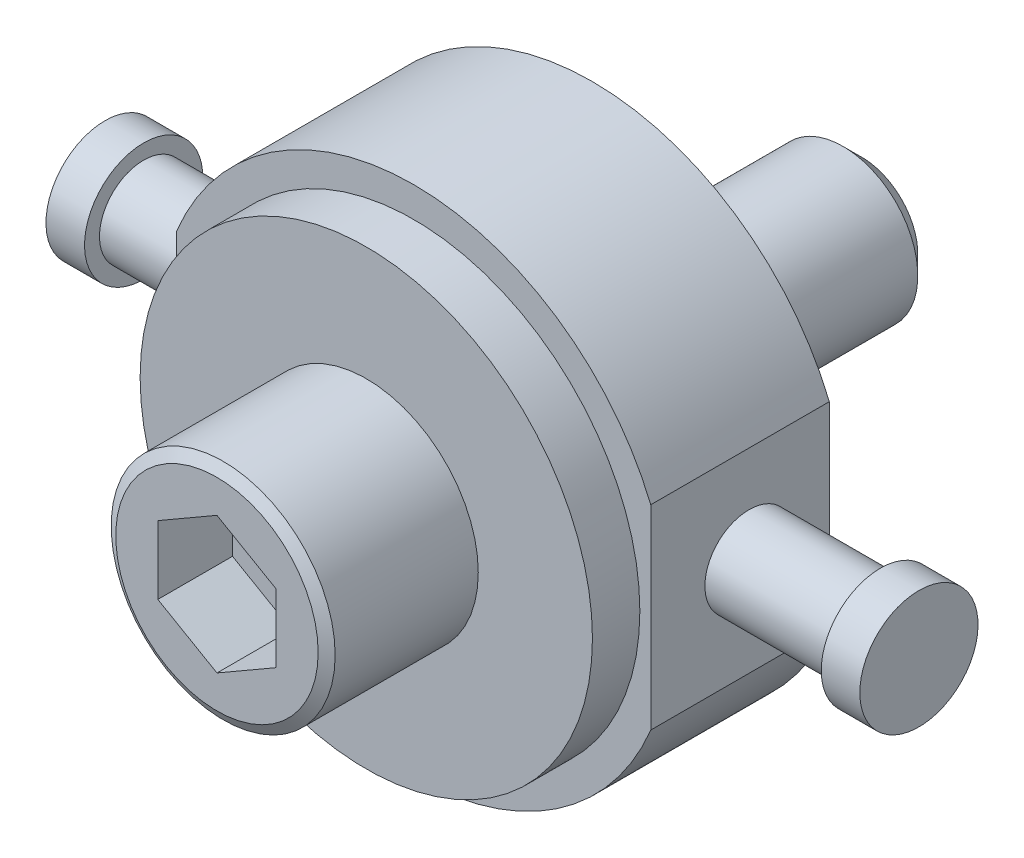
ISO-10303-21;
HEADER;
FILE_DESCRIPTION(('STEP AP214'),'2;1');
FILE_NAME('part.step','',(''),(''),'','','');
FILE_SCHEMA(('AUTOMOTIVE_DESIGN { 1 0 10303 214 1 1 1 1 }'));
ENDSEC;
DATA;
#1=APPLICATION_CONTEXT('core data for automotive mechanical design processes');
#2=APPLICATION_PROTOCOL_DEFINITION('international standard','automotive_design',2000,#1);
#3=PRODUCT_CONTEXT('',#1,'mechanical');
#4=PRODUCT('Part','Part','',(#3));
#5=PRODUCT_RELATED_PRODUCT_CATEGORY('part','',(#4));
#6=PRODUCT_DEFINITION_FORMATION('','',#4);
#7=PRODUCT_DEFINITION_CONTEXT('part definition',#1,'design');
#8=PRODUCT_DEFINITION('design','',#6,#7);
#9=PRODUCT_DEFINITION_SHAPE('','',#8);
#10=(LENGTH_UNIT() NAMED_UNIT(*) SI_UNIT(.MILLI.,.METRE.));
#11=(NAMED_UNIT(*) PLANE_ANGLE_UNIT() SI_UNIT($,.RADIAN.));
#12=(NAMED_UNIT(*) SI_UNIT($,.STERADIAN.) SOLID_ANGLE_UNIT());
#13=UNCERTAINTY_MEASURE_WITH_UNIT(LENGTH_MEASURE(1.E-05),#10,'distance_accuracy_value','');
#14=(GEOMETRIC_REPRESENTATION_CONTEXT(3) GLOBAL_UNCERTAINTY_ASSIGNED_CONTEXT((#13)) GLOBAL_UNIT_ASSIGNED_CONTEXT((#10,
#11,#12)) REPRESENTATION_CONTEXT('',''));
#15=CARTESIAN_POINT('',(0.,0.,0.));
#16=DIRECTION('',(0.,0.,1.));
#17=DIRECTION('',(1.,0.,0.));
#18=AXIS2_PLACEMENT_3D('',#15,#16,#17);
#19=CARTESIAN_POINT('',(59.2,0.,19.22));
#20=DIRECTION('',(1.,0.,0.));
#21=DIRECTION('',(0.,1.,0.));
#22=AXIS2_PLACEMENT_3D('',#19,#20,#21);
#23=PLANE('',#22);
#24=CARTESIAN_POINT('',(59.2,0.,19.22));
#25=DIRECTION('',(1.,0.,0.));
#26=DIRECTION('',(0.,0.,-1.));
#27=AXIS2_PLACEMENT_3D('',#24,#25,#26);
#28=CIRCLE('',#27,7.1);
#29=CARTESIAN_POINT('',(59.2,0.,12.12));
#30=VERTEX_POINT('',#29);
#31=EDGE_CURVE('E161',#30,#30,#28,.F.);
#32=ORIENTED_EDGE('',*,*,#31,.F.);
#33=EDGE_LOOP('',(#32));
#34=FACE_BOUND('',#33,.T.);
#35=CARTESIAN_POINT('',(59.2,0.,19.22));
#36=DIRECTION('',(1.,0.,0.));
#37=DIRECTION('',(0.,1.,0.));
#38=AXIS2_PLACEMENT_3D('',#35,#36,#37);
#39=CIRCLE('',#38,9.5);
#40=CARTESIAN_POINT('',(59.2,9.50000000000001,19.22));
#41=VERTEX_POINT('',#40);
#42=EDGE_CURVE('E193',#41,#41,#39,.T.);
#43=ORIENTED_EDGE('',*,*,#42,.F.);
#44=EDGE_LOOP('',(#43));
#45=FACE_BOUND('',#44,.T.);
#46=ADVANCED_FACE('F14',(#34,#45),#23,.F.);
#47=CARTESIAN_POINT('',(-59.2,0.,19.22));
#48=DIRECTION('',(1.,0.,0.));
#49=DIRECTION('',(0.,1.,0.));
#50=AXIS2_PLACEMENT_3D('',#47,#48,#49);
#51=PLANE('',#50);
#52=CARTESIAN_POINT('',(-59.2,0.,19.22));
#53=DIRECTION('',(1.,0.,0.));
#54=DIRECTION('',(0.,0.,-1.));
#55=AXIS2_PLACEMENT_3D('',#52,#53,#54);
#56=CIRCLE('',#55,7.1);
#57=CARTESIAN_POINT('',(-59.2,0.,12.12));
#58=VERTEX_POINT('',#57);
#59=EDGE_CURVE('E150',#58,#58,#56,.T.);
#60=ORIENTED_EDGE('',*,*,#59,.F.);
#61=EDGE_LOOP('',(#60));
#62=FACE_BOUND('',#61,.T.);
#63=CARTESIAN_POINT('',(-59.2,0.,19.22));
#64=DIRECTION('',(1.,0.,0.));
#65=DIRECTION('',(0.,1.,0.));
#66=AXIS2_PLACEMENT_3D('',#63,#64,#65);
#67=CIRCLE('',#66,9.5);
#68=CARTESIAN_POINT('',(-59.2,9.49999999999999,19.22));
#69=VERTEX_POINT('',#68);
#70=EDGE_CURVE('E24',#69,#69,#67,.T.);
#71=ORIENTED_EDGE('',*,*,#70,.T.);
#72=EDGE_LOOP('',(#71));
#73=FACE_BOUND('',#72,.T.);
#74=ADVANCED_FACE('F230',(#62,#73),#51,.T.);
#75=CARTESIAN_POINT('',(61.1,0.,19.22));
#76=DIRECTION('',(-1.,0.,0.));
#77=DIRECTION('',(0.,-1.,0.));
#78=AXIS2_PLACEMENT_3D('',#75,#76,#77);
#79=CYLINDRICAL_SURFACE('',#78,7.1);
#80=CARTESIAN_POINT('',(38.1,0.,19.22));
#81=DIRECTION('',(1.,0.,0.));
#82=DIRECTION('',(0.,1.,0.));
#83=AXIS2_PLACEMENT_3D('',#80,#81,#82);
#84=CIRCLE('',#83,7.1);
#85=CARTESIAN_POINT('',(38.1,7.09999999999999,19.22));
#86=VERTEX_POINT('',#85);
#87=EDGE_CURVE('E158',#86,#86,#84,.T.);
#88=ORIENTED_EDGE('',*,*,#87,.T.);
#89=EDGE_LOOP('',(#88));
#90=FACE_BOUND('',#89,.T.);
#91=ORIENTED_EDGE('',*,*,#31,.T.);
#92=EDGE_LOOP('',(#91));
#93=FACE_BOUND('',#92,.T.);
#94=ADVANCED_FACE('F236',(#90,#93),#79,.T.);
#95=CARTESIAN_POINT('',(0.,0.,0.));
#96=DIRECTION('',(0.,0.,1.));
#97=DIRECTION('',(1.,0.,0.));
#98=AXIS2_PLACEMENT_3D('',#95,#96,#97);
#99=PLANE('',#98);
#100=CARTESIAN_POINT('',(0.,0.,0.));
#101=DIRECTION('',(0.,0.,1.));
#102=DIRECTION('',(1.,0.,0.));
#103=AXIS2_PLACEMENT_3D('',#100,#101,#102);
#104=CIRCLE('',#103,29.3);
#105=CARTESIAN_POINT('',(29.3,0.,0.));
#106=VERTEX_POINT('',#105);
#107=EDGE_CURVE('E174',#106,#106,#104,.T.);
#108=ORIENTED_EDGE('',*,*,#107,.F.);
#109=EDGE_LOOP('',(#108));
#110=FACE_BOUND('',#109,.T.);
#111=CARTESIAN_POINT('',(0.,0.,0.));
#112=DIRECTION('',(0.,0.,-1.));
#113=DIRECTION('',(-1.,0.,0.));
#114=AXIS2_PLACEMENT_3D('',#111,#112,#113);
#115=CIRCLE('',#114,12.);
#116=CARTESIAN_POINT('',(-12.,0.,0.));
#117=VERTEX_POINT('',#116);
#118=EDGE_CURVE('E137',#117,#117,#115,.T.);
#119=ORIENTED_EDGE('',*,*,#118,.F.);
#120=EDGE_LOOP('',(#119));
#121=FACE_BOUND('',#120,.T.);
#122=ADVANCED_FACE('F291',(#110,#121),#99,.F.);
#123=CARTESIAN_POINT('',(0.,0.,6.32));
#124=DIRECTION('',(0.,0.,-1.));
#125=DIRECTION('',(-1.,0.,0.));
#126=AXIS2_PLACEMENT_3D('',#123,#124,#125);
#127=CYLINDRICAL_SURFACE('',#126,29.3);
#128=CARTESIAN_POINT('',(0.,0.,6.32));
#129=DIRECTION('',(0.,0.,1.));
#130=DIRECTION('',(1.,0.,0.));
#131=AXIS2_PLACEMENT_3D('',#128,#129,#130);
#132=CIRCLE('',#131,29.3);
#133=CARTESIAN_POINT('',(29.3,0.,6.32));
#134=VERTEX_POINT('',#133);
#135=EDGE_CURVE('E173',#134,#134,#132,.T.);
#136=ORIENTED_EDGE('',*,*,#135,.F.);
#137=EDGE_LOOP('',(#136));
#138=FACE_BOUND('',#137,.T.);
#139=ORIENTED_EDGE('',*,*,#107,.T.);
#140=EDGE_LOOP('',(#139));
#141=FACE_BOUND('',#140,.T.);
#142=ADVANCED_FACE('F297',(#138,#141),#127,.T.);
#143=CARTESIAN_POINT('',(0.,0.,6.32));
#144=DIRECTION('',(0.,0.,1.));
#145=DIRECTION('',(1.,0.,0.));
#146=AXIS2_PLACEMENT_3D('',#143,#144,#145);
#147=PLANE('',#146);
#148=CARTESIAN_POINT('',(0.,0.,6.32));
#149=DIRECTION('',(0.,0.,1.));
#150=DIRECTION('',(1.,0.,0.));
#151=AXIS2_PLACEMENT_3D('',#148,#149,#150);
#152=CIRCLE('',#151,41.2);
#153=CARTESIAN_POINT('',(38.1,15.6789668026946,6.32));
#154=VERTEX_POINT('',#153);
#155=CARTESIAN_POINT('',(-38.1,15.6789668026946,6.32));
#156=VERTEX_POINT('',#155);
#157=EDGE_CURVE('E157',#154,#156,#152,.T.);
#158=ORIENTED_EDGE('',*,*,#157,.F.);
#159=DIRECTION('',(0.,-1.,0.));
#160=VECTOR('',#159,1.);
#161=CARTESIAN_POINT('',(38.1,15.6789668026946,6.32));
#162=LINE('',#161,#160);
#163=CARTESIAN_POINT('',(38.1,-15.6789668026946,6.32));
#164=VERTEX_POINT('',#163);
#165=EDGE_CURVE('E170',#154,#164,#162,.T.);
#166=ORIENTED_EDGE('',*,*,#165,.T.);
#167=CARTESIAN_POINT('',(-38.1,-15.6789668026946,6.32));
#168=VERTEX_POINT('',#167);
#169=EDGE_CURVE('E166',#168,#164,#152,.T.);
#170=ORIENTED_EDGE('',*,*,#169,.F.);
#171=DIRECTION('',(0.,-1.,0.));
#172=VECTOR('',#171,1.);
#173=CARTESIAN_POINT('',(-38.1,15.6789668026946,6.32));
#174=LINE('',#173,#172);
#175=EDGE_CURVE('E162',#156,#168,#174,.T.);
#176=ORIENTED_EDGE('',*,*,#175,.F.);
#177=EDGE_LOOP('',(#158,#166,#170,#176));
#178=FACE_BOUND('',#177,.T.);
#179=ORIENTED_EDGE('',*,*,#135,.T.);
#180=EDGE_LOOP('',(#179));
#181=FACE_BOUND('',#180,.T.);
#182=ADVANCED_FACE('F293',(#178,#181),#147,.F.);
#183=CARTESIAN_POINT('',(0.,0.,35.02));
#184=DIRECTION('',(0.,0.,-1.));
#185=DIRECTION('',(-1.,0.,0.));
#186=AXIS2_PLACEMENT_3D('',#183,#184,#185);
#187=CYLINDRICAL_SURFACE('',#186,41.2);
#188=DIRECTION('',(0.,0.,-1.));
#189=VECTOR('',#188,1.);
#190=CARTESIAN_POINT('',(-38.1,15.6789668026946,35.02));
#191=LINE('',#190,#189);
#192=CARTESIAN_POINT('',(-38.1,15.6789668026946,35.02));
#193=VERTEX_POINT('',#192);
#194=EDGE_CURVE('E156',#193,#156,#191,.T.);
#195=ORIENTED_EDGE('',*,*,#194,.F.);
#196=CARTESIAN_POINT('',(0.,0.,35.02));
#197=DIRECTION('',(0.,0.,1.));
#198=DIRECTION('',(1.,0.,0.));
#199=AXIS2_PLACEMENT_3D('',#196,#197,#198);
#200=CIRCLE('',#199,41.2);
#201=CARTESIAN_POINT('',(38.1,15.6789668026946,35.02));
#202=VERTEX_POINT('',#201);
#203=EDGE_CURVE('E179',#202,#193,#200,.T.);
#204=ORIENTED_EDGE('',*,*,#203,.F.);
#205=DIRECTION('',(0.,0.,-1.));
#206=VECTOR('',#205,1.);
#207=CARTESIAN_POINT('',(38.1,15.6789668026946,35.02));
#208=LINE('',#207,#206);
#209=EDGE_CURVE('E67',#202,#154,#208,.T.);
#210=ORIENTED_EDGE('',*,*,#209,.T.);
#211=ORIENTED_EDGE('',*,*,#157,.T.);
#212=EDGE_LOOP('',(#195,#204,#210,#211));
#213=FACE_BOUND('',#212,.T.);
#214=ADVANCED_FACE('F296',(#213),#187,.T.);
#215=CARTESIAN_POINT('',(-38.1,15.6789668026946,35.02));
#216=DIRECTION('',(1.,0.,0.));
#217=DIRECTION('',(0.,1.,0.));
#218=AXIS2_PLACEMENT_3D('',#215,#216,#217);
#219=PLANE('',#218);
#220=CARTESIAN_POINT('',(-38.1,0.,19.22));
#221=DIRECTION('',(1.,0.,0.));
#222=DIRECTION('',(0.,1.,0.));
#223=AXIS2_PLACEMENT_3D('',#220,#221,#222);
#224=CIRCLE('',#223,7.1);
#225=CARTESIAN_POINT('',(-38.1,7.09999999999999,19.22));
#226=VERTEX_POINT('',#225);
#227=EDGE_CURVE('E153',#226,#226,#224,.T.);
#228=ORIENTED_EDGE('',*,*,#227,.T.);
#229=EDGE_LOOP('',(#228));
#230=FACE_BOUND('',#229,.T.);
#231=DIRECTION('',(0.,0.,-1.));
#232=VECTOR('',#231,1.);
#233=CARTESIAN_POINT('',(-38.1,-15.6789668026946,35.02));
#234=LINE('',#233,#232);
#235=CARTESIAN_POINT('',(-38.1,-15.6789668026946,35.02));
#236=VERTEX_POINT('',#235);
#237=EDGE_CURVE('E165',#236,#168,#234,.T.);
#238=ORIENTED_EDGE('',*,*,#237,.F.);
#239=DIRECTION('',(0.,-1.,0.));
#240=VECTOR('',#239,1.);
#241=CARTESIAN_POINT('',(-38.1,15.6789668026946,35.02));
#242=LINE('',#241,#240);
#243=EDGE_CURVE('E175',#193,#236,#242,.T.);
#244=ORIENTED_EDGE('',*,*,#243,.F.);
#245=ORIENTED_EDGE('',*,*,#194,.T.);
#246=ORIENTED_EDGE('',*,*,#175,.T.);
#247=EDGE_LOOP('',(#238,#244,#245,#246));
#248=FACE_BOUND('',#247,.T.);
#249=ADVANCED_FACE('F305',(#230,#248),#219,.F.);
#250=DIRECTION('',(0.,0.,-1.));
#251=VECTOR('',#250,1.);
#252=CARTESIAN_POINT('',(38.1,-15.6789668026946,35.02));
#253=LINE('',#252,#251);
#254=CARTESIAN_POINT('',(38.1,-15.6789668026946,35.02));
#255=VERTEX_POINT('',#254);
#256=EDGE_CURVE('E183',#255,#164,#253,.T.);
#257=ORIENTED_EDGE('',*,*,#256,.F.);
#258=EDGE_CURVE('E178',#236,#255,#200,.T.);
#259=ORIENTED_EDGE('',*,*,#258,.F.);
#260=ORIENTED_EDGE('',*,*,#237,.T.);
#261=ORIENTED_EDGE('',*,*,#169,.T.);
#262=EDGE_LOOP('',(#257,#259,#260,#261));
#263=FACE_BOUND('',#262,.T.);
#264=ADVANCED_FACE('F302',(#263),#187,.T.);
#265=CARTESIAN_POINT('',(38.1,15.6789668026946,35.02));
#266=DIRECTION('',(1.,0.,0.));
#267=DIRECTION('',(0.,1.,0.));
#268=AXIS2_PLACEMENT_3D('',#265,#266,#267);
#269=PLANE('',#268);
#270=ORIENTED_EDGE('',*,*,#87,.F.);
#271=EDGE_LOOP('',(#270));
#272=FACE_BOUND('',#271,.T.);
#273=DIRECTION('',(0.,-1.,0.));
#274=VECTOR('',#273,1.);
#275=CARTESIAN_POINT('',(38.1,15.6789668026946,35.02));
#276=LINE('',#275,#274);
#277=EDGE_CURVE('E169',#202,#255,#276,.T.);
#278=ORIENTED_EDGE('',*,*,#277,.T.);
#279=ORIENTED_EDGE('',*,*,#256,.T.);
#280=ORIENTED_EDGE('',*,*,#165,.F.);
#281=ORIENTED_EDGE('',*,*,#209,.F.);
#282=EDGE_LOOP('',(#278,#279,#280,#281));
#283=FACE_BOUND('',#282,.T.);
#284=ADVANCED_FACE('F288',(#272,#283),#269,.T.);
#285=CARTESIAN_POINT('',(0.,0.,35.02));
#286=DIRECTION('',(0.,0.,1.));
#287=DIRECTION('',(1.,0.,0.));
#288=AXIS2_PLACEMENT_3D('',#285,#286,#287);
#289=PLANE('',#288);
#290=CARTESIAN_POINT('',(0.,0.,35.02));
#291=DIRECTION('',(0.,0.,1.));
#292=DIRECTION('',(1.,0.,0.));
#293=AXIS2_PLACEMENT_3D('',#290,#291,#292);
#294=CIRCLE('',#293,36.35);
#295=CARTESIAN_POINT('',(36.35,0.,35.02));
#296=VERTEX_POINT('',#295);
#297=EDGE_CURVE('E146',#296,#296,#294,.T.);
#298=ORIENTED_EDGE('',*,*,#297,.F.);
#299=EDGE_LOOP('',(#298));
#300=FACE_BOUND('',#299,.T.);
#301=ORIENTED_EDGE('',*,*,#203,.T.);
#302=ORIENTED_EDGE('',*,*,#243,.T.);
#303=ORIENTED_EDGE('',*,*,#258,.T.);
#304=ORIENTED_EDGE('',*,*,#277,.F.);
#305=EDGE_LOOP('',(#301,#302,#303,#304));
#306=FACE_BOUND('',#305,.T.);
#307=ADVANCED_FACE('F286',(#300,#306),#289,.T.);
#308=CARTESIAN_POINT('',(-61.1,0.,19.22));
#309=DIRECTION('',(1.,0.,0.));
#310=DIRECTION('',(0.,1.,0.));
#311=AXIS2_PLACEMENT_3D('',#308,#309,#310);
#312=CYLINDRICAL_SURFACE('',#311,7.1);
#313=ORIENTED_EDGE('',*,*,#59,.T.);
#314=EDGE_LOOP('',(#313));
#315=FACE_BOUND('',#314,.T.);
#316=ORIENTED_EDGE('',*,*,#227,.F.);
#317=EDGE_LOOP('',(#316));
#318=FACE_BOUND('',#317,.T.);
#319=ADVANCED_FACE('F280',(#315,#318),#312,.T.);
#320=CARTESIAN_POINT('',(0.,0.,42.64));
#321=DIRECTION('',(0.,0.,-1.));
#322=DIRECTION('',(-1.,0.,0.));
#323=AXIS2_PLACEMENT_3D('',#320,#321,#322);
#324=CYLINDRICAL_SURFACE('',#323,36.35);
#325=CARTESIAN_POINT('',(0.,0.,42.64));
#326=DIRECTION('',(0.,0.,1.));
#327=DIRECTION('',(1.,0.,0.));
#328=AXIS2_PLACEMENT_3D('',#325,#326,#327);
#329=CIRCLE('',#328,36.35);
#330=CARTESIAN_POINT('',(36.35,0.,42.64));
#331=VERTEX_POINT('',#330);
#332=EDGE_CURVE('E149',#331,#331,#329,.T.);
#333=ORIENTED_EDGE('',*,*,#332,.F.);
#334=EDGE_LOOP('',(#333));
#335=FACE_BOUND('',#334,.T.);
#336=ORIENTED_EDGE('',*,*,#297,.T.);
#337=EDGE_LOOP('',(#336));
#338=FACE_BOUND('',#337,.T.);
#339=ADVANCED_FACE('F273',(#335,#338),#324,.T.);
#340=CARTESIAN_POINT('',(0.,0.,42.64));
#341=DIRECTION('',(0.,0.,1.));
#342=DIRECTION('',(1.,0.,0.));
#343=AXIS2_PLACEMENT_3D('',#340,#341,#342);
#344=PLANE('',#343);
#345=CARTESIAN_POINT('',(0.,0.,42.64));
#346=DIRECTION('',(0.,0.,1.));
#347=DIRECTION('',(1.,0.,0.));
#348=AXIS2_PLACEMENT_3D('',#345,#346,#347);
#349=CIRCLE('',#348,18.);
#350=CARTESIAN_POINT('',(18.,0.,42.64));
#351=VERTEX_POINT('',#350);
#352=EDGE_CURVE('E142',#351,#351,#349,.T.);
#353=ORIENTED_EDGE('',*,*,#352,.F.);
#354=EDGE_LOOP('',(#353));
#355=FACE_BOUND('',#354,.T.);
#356=ORIENTED_EDGE('',*,*,#332,.T.);
#357=EDGE_LOOP('',(#356));
#358=FACE_BOUND('',#357,.T.);
#359=ADVANCED_FACE('F271',(#355,#358),#344,.T.);
#360=CARTESIAN_POINT('',(0.,0.,66.64));
#361=DIRECTION('',(0.,0.,-1.));
#362=DIRECTION('',(-1.,0.,0.));
#363=AXIS2_PLACEMENT_3D('',#360,#361,#362);
#364=CYLINDRICAL_SURFACE('',#363,18.);
#365=CARTESIAN_POINT('',(0.,0.,65.64));
#366=DIRECTION('',(0.,0.,1.));
#367=DIRECTION('',(1.,0.,0.));
#368=AXIS2_PLACEMENT_3D('',#365,#366,#367);
#369=CIRCLE('',#368,18.);
#370=CARTESIAN_POINT('',(18.,0.,65.64));
#371=VERTEX_POINT('',#370);
#372=EDGE_CURVE('E145',#371,#371,#369,.F.);
#373=ORIENTED_EDGE('',*,*,#372,.T.);
#374=EDGE_LOOP('',(#373));
#375=FACE_BOUND('',#374,.T.);
#376=ORIENTED_EDGE('',*,*,#352,.T.);
#377=EDGE_LOOP('',(#376));
#378=FACE_BOUND('',#377,.T.);
#379=ADVANCED_FACE('F211',(#375,#378),#364,.T.);
#380=CARTESIAN_POINT('',(0.,0.,-37.));
#381=DIRECTION('',(0.,0.,1.));
#382=DIRECTION('',(1.,0.,0.));
#383=AXIS2_PLACEMENT_3D('',#380,#381,#382);
#384=CYLINDRICAL_SURFACE('',#383,12.);
#385=CARTESIAN_POINT('',(0.,0.,-34.));
#386=DIRECTION('',(0.,0.,-1.));
#387=DIRECTION('',(-1.,0.,0.));
#388=AXIS2_PLACEMENT_3D('',#385,#386,#387);
#389=CIRCLE('',#388,12.);
#390=CARTESIAN_POINT('',(-12.,0.,-34.));
#391=VERTEX_POINT('',#390);
#392=EDGE_CURVE('E141',#391,#391,#389,.F.);
#393=ORIENTED_EDGE('',*,*,#392,.T.);
#394=EDGE_LOOP('',(#393));
#395=FACE_BOUND('',#394,.T.);
#396=ORIENTED_EDGE('',*,*,#118,.T.);
#397=EDGE_LOOP('',(#396));
#398=FACE_BOUND('',#397,.T.);
#399=ADVANCED_FACE('F253',(#395,#398),#384,.T.);
#400=CARTESIAN_POINT('',(0.,0.,-37.));
#401=DIRECTION('',(0.,0.,-1.));
#402=DIRECTION('',(-1.,0.,0.));
#403=AXIS2_PLACEMENT_3D('',#400,#401,#402);
#404=PLANE('',#403);
#405=CARTESIAN_POINT('',(0.,0.,-37.));
#406=DIRECTION('',(0.,0.,-1.));
#407=DIRECTION('',(-1.,0.,0.));
#408=AXIS2_PLACEMENT_3D('',#405,#406,#407);
#409=CIRCLE('',#408,9.);
#410=CARTESIAN_POINT('',(-9.,0.,-37.));
#411=VERTEX_POINT('',#410);
#412=EDGE_CURVE('E140',#411,#411,#409,.T.);
#413=ORIENTED_EDGE('',*,*,#412,.T.);
#414=EDGE_LOOP('',(#413));
#415=FACE_BOUND('',#414,.T.);
#416=ADVANCED_FACE('F251',(#415),#404,.T.);
#417=CARTESIAN_POINT('',(0.,0.,-37.));
#418=DIRECTION('',(0.,0.,1.));
#419=DIRECTION('',(1.,0.,0.));
#420=AXIS2_PLACEMENT_3D('',#417,#418,#419);
#421=CONICAL_SURFACE('',#420,9.,0.785398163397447);
#422=ORIENTED_EDGE('',*,*,#392,.F.);
#423=EDGE_LOOP('',(#422));
#424=FACE_BOUND('',#423,.T.);
#425=ORIENTED_EDGE('',*,*,#412,.F.);
#426=EDGE_LOOP('',(#425));
#427=FACE_BOUND('',#426,.T.);
#428=ADVANCED_FACE('F248',(#424,#427),#421,.T.);
#429=CARTESIAN_POINT('',(0.,10.9696551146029,54.64));
#430=DIRECTION('',(0.,0.,1.));
#431=DIRECTION('',(1.,0.,0.));
#432=AXIS2_PLACEMENT_3D('',#429,#430,#431);
#433=PLANE('',#432);
#434=DIRECTION('',(-0.866025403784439,0.5,0.));
#435=VECTOR('',#434,1.);
#436=CARTESIAN_POINT('',(9.5,5.48482755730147,54.64));
#437=LINE('',#436,#435);
#438=CARTESIAN_POINT('',(9.5,5.48482755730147,54.64));
#439=VERTEX_POINT('',#438);
#440=CARTESIAN_POINT('',(0.,10.9696551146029,54.64));
#441=VERTEX_POINT('',#440);
#442=EDGE_CURVE('E206',#439,#441,#437,.T.);
#443=ORIENTED_EDGE('',*,*,#442,.T.);
#444=DIRECTION('',(-0.866025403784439,-0.5,0.));
#445=VECTOR('',#444,1.);
#446=CARTESIAN_POINT('',(0.,10.9696551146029,54.64));
#447=LINE('',#446,#445);
#448=CARTESIAN_POINT('',(-9.5,5.48482755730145,54.64));
#449=VERTEX_POINT('',#448);
#450=EDGE_CURVE('E557',#441,#449,#447,.T.);
#451=ORIENTED_EDGE('',*,*,#450,.T.);
#452=DIRECTION('',(0.,-1.,0.));
#453=VECTOR('',#452,1.);
#454=CARTESIAN_POINT('',(-9.5,5.48482755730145,54.64));
#455=LINE('',#454,#453);
#456=CARTESIAN_POINT('',(-9.5,-5.48482755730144,54.64));
#457=VERTEX_POINT('',#456);
#458=EDGE_CURVE('E554',#449,#457,#455,.T.);
#459=ORIENTED_EDGE('',*,*,#458,.T.);
#460=DIRECTION('',(0.866025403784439,-0.5,0.));
#461=VECTOR('',#460,1.);
#462=CARTESIAN_POINT('',(-9.5,-5.48482755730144,54.64));
#463=LINE('',#462,#461);
#464=CARTESIAN_POINT('',(0.,-10.9696551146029,54.64));
#465=VERTEX_POINT('',#464);
#466=EDGE_CURVE('E552',#457,#465,#463,.T.);
#467=ORIENTED_EDGE('',*,*,#466,.T.);
#468=DIRECTION('',(0.866025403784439,0.5,0.));
#469=VECTOR('',#468,1.);
#470=CARTESIAN_POINT('',(0.,-10.9696551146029,54.64));
#471=LINE('',#470,#469);
#472=CARTESIAN_POINT('',(9.5,-5.48482755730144,54.64));
#473=VERTEX_POINT('',#472);
#474=EDGE_CURVE('E105',#465,#473,#471,.T.);
#475=ORIENTED_EDGE('',*,*,#474,.T.);
#476=DIRECTION('',(0.,1.,0.));
#477=VECTOR('',#476,1.);
#478=CARTESIAN_POINT('',(9.5,-5.48482755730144,54.64));
#479=LINE('',#478,#477);
#480=EDGE_CURVE('E545',#473,#439,#479,.T.);
#481=ORIENTED_EDGE('',*,*,#480,.T.);
#482=EDGE_LOOP('',(#443,#451,#459,#467,#475,#481));
#483=FACE_BOUND('',#482,.T.);
#484=ADVANCED_FACE('F250',(#483),#433,.T.);
#485=CARTESIAN_POINT('',(0.,10.9696551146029,54.64));
#486=DIRECTION('',(-0.5,0.866025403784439,0.));
#487=DIRECTION('',(-0.866025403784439,-0.5,0.));
#488=AXIS2_PLACEMENT_3D('',#485,#486,#487);
#489=PLANE('',#488);
#490=DIRECTION('',(-0.866025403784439,-0.5,0.));
#491=VECTOR('',#490,1.);
#492=CARTESIAN_POINT('',(0.,10.9696551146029,66.64));
#493=LINE('',#492,#491);
#494=CARTESIAN_POINT('',(0.,10.9696551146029,66.64));
#495=VERTEX_POINT('',#494);
#496=CARTESIAN_POINT('',(-9.5,5.48482755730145,66.64));
#497=VERTEX_POINT('',#496);
#498=EDGE_CURVE('E136',#495,#497,#493,.T.);
#499=ORIENTED_EDGE('',*,*,#498,.T.);
#500=DIRECTION('',(0.,0.,1.));
#501=VECTOR('',#500,1.);
#502=CARTESIAN_POINT('',(-9.5,5.48482755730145,54.64));
#503=LINE('',#502,#501);
#504=EDGE_CURVE('E76',#449,#497,#503,.T.);
#505=ORIENTED_EDGE('',*,*,#504,.F.);
#506=ORIENTED_EDGE('',*,*,#450,.F.);
#507=DIRECTION('',(0.,0.,1.));
#508=VECTOR('',#507,1.);
#509=CARTESIAN_POINT('',(0.,10.9696551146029,54.64));
#510=LINE('',#509,#508);
#511=EDGE_CURVE('E133',#441,#495,#510,.T.);
#512=ORIENTED_EDGE('',*,*,#511,.T.);
#513=EDGE_LOOP('',(#499,#505,#506,#512));
#514=FACE_BOUND('',#513,.T.);
#515=ADVANCED_FACE('F258',(#514),#489,.F.);
#516=CARTESIAN_POINT('',(-9.5,5.48482755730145,54.64));
#517=DIRECTION('',(-1.,0.,0.));
#518=DIRECTION('',(0.,-1.,0.));
#519=AXIS2_PLACEMENT_3D('',#516,#517,#518);
#520=PLANE('',#519);
#521=DIRECTION('',(0.,-1.,0.));
#522=VECTOR('',#521,1.);
#523=CARTESIAN_POINT('',(-9.5,5.48482755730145,66.64));
#524=LINE('',#523,#522);
#525=CARTESIAN_POINT('',(-9.5,-5.48482755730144,66.64));
#526=VERTEX_POINT('',#525);
#527=EDGE_CURVE('E132',#497,#526,#524,.T.);
#528=ORIENTED_EDGE('',*,*,#527,.T.);
#529=DIRECTION('',(0.,0.,1.));
#530=VECTOR('',#529,1.);
#531=CARTESIAN_POINT('',(-9.5,-5.48482755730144,54.64));
#532=LINE('',#531,#530);
#533=EDGE_CURVE('E114',#457,#526,#532,.T.);
#534=ORIENTED_EDGE('',*,*,#533,.F.);
#535=ORIENTED_EDGE('',*,*,#458,.F.);
#536=ORIENTED_EDGE('',*,*,#504,.T.);
#537=EDGE_LOOP('',(#528,#534,#535,#536));
#538=FACE_BOUND('',#537,.T.);
#539=ADVANCED_FACE('F400',(#538),#520,.F.);
#540=CARTESIAN_POINT('',(-9.5,-5.48482755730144,54.64));
#541=DIRECTION('',(-0.5,-0.866025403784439,0.));
#542=DIRECTION('',(0.866025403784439,-0.5,0.));
#543=AXIS2_PLACEMENT_3D('',#540,#541,#542);
#544=PLANE('',#543);
#545=DIRECTION('',(0.866025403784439,-0.5,0.));
#546=VECTOR('',#545,1.);
#547=CARTESIAN_POINT('',(-9.5,-5.48482755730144,66.64));
#548=LINE('',#547,#546);
#549=CARTESIAN_POINT('',(0.,-10.9696551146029,66.64));
#550=VERTEX_POINT('',#549);
#551=EDGE_CURVE('E112',#526,#550,#548,.T.);
#552=ORIENTED_EDGE('',*,*,#551,.T.);
#553=DIRECTION('',(0.,0.,1.));
#554=VECTOR('',#553,1.);
#555=CARTESIAN_POINT('',(0.,-10.9696551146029,54.64));
#556=LINE('',#555,#554);
#557=EDGE_CURVE('E98',#465,#550,#556,.T.);
#558=ORIENTED_EDGE('',*,*,#557,.F.);
#559=ORIENTED_EDGE('',*,*,#466,.F.);
#560=ORIENTED_EDGE('',*,*,#533,.T.);
#561=EDGE_LOOP('',(#552,#558,#559,#560));
#562=FACE_BOUND('',#561,.T.);
#563=ADVANCED_FACE('F113',(#562),#544,.F.);
#564=CARTESIAN_POINT('',(0.,-10.9696551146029,54.64));
#565=DIRECTION('',(0.5,-0.866025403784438,0.));
#566=DIRECTION('',(0.866025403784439,0.5,0.));
#567=AXIS2_PLACEMENT_3D('',#564,#565,#566);
#568=PLANE('',#567);
#569=DIRECTION('',(0.866025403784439,0.5,0.));
#570=VECTOR('',#569,1.);
#571=CARTESIAN_POINT('',(0.,-10.9696551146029,66.64));
#572=LINE('',#571,#570);
#573=CARTESIAN_POINT('',(9.5,-5.48482755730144,66.64));
#574=VERTEX_POINT('',#573);
#575=EDGE_CURVE('E102',#550,#574,#572,.T.);
#576=ORIENTED_EDGE('',*,*,#575,.T.);
#577=DIRECTION('',(0.,0.,1.));
#578=VECTOR('',#577,1.);
#579=CARTESIAN_POINT('',(9.5,-5.48482755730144,54.64));
#580=LINE('',#579,#578);
#581=EDGE_CURVE('E126',#473,#574,#580,.T.);
#582=ORIENTED_EDGE('',*,*,#581,.F.);
#583=ORIENTED_EDGE('',*,*,#474,.F.);
#584=ORIENTED_EDGE('',*,*,#557,.T.);
#585=EDGE_LOOP('',(#576,#582,#583,#584));
#586=FACE_BOUND('',#585,.T.);
#587=ADVANCED_FACE('F100',(#586),#568,.F.);
#588=CARTESIAN_POINT('',(9.5,-5.48482755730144,54.64));
#589=DIRECTION('',(1.,0.,0.));
#590=DIRECTION('',(0.,0.,-1.));
#591=AXIS2_PLACEMENT_3D('',#588,#589,#590);
#592=PLANE('',#591);
#593=DIRECTION('',(0.,1.,0.));
#594=VECTOR('',#593,1.);
#595=CARTESIAN_POINT('',(9.5,-5.48482755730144,66.64));
#596=LINE('',#595,#594);
#597=CARTESIAN_POINT('',(9.5,5.48482755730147,66.64));
#598=VERTEX_POINT('',#597);
#599=EDGE_CURVE('E109',#574,#598,#596,.T.);
#600=ORIENTED_EDGE('',*,*,#599,.T.);
#601=DIRECTION('',(0.,0.,1.));
#602=VECTOR('',#601,1.);
#603=CARTESIAN_POINT('',(9.5,5.48482755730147,54.64));
#604=LINE('',#603,#602);
#605=EDGE_CURVE('E33',#439,#598,#604,.T.);
#606=ORIENTED_EDGE('',*,*,#605,.F.);
#607=ORIENTED_EDGE('',*,*,#480,.F.);
#608=ORIENTED_EDGE('',*,*,#581,.T.);
#609=EDGE_LOOP('',(#600,#606,#607,#608));
#610=FACE_BOUND('',#609,.T.);
#611=ADVANCED_FACE('F375',(#610),#592,.F.);
#612=CARTESIAN_POINT('',(9.5,5.48482755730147,54.64));
#613=DIRECTION('',(0.5,0.866025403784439,0.));
#614=DIRECTION('',(-0.866025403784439,0.5,0.));
#615=AXIS2_PLACEMENT_3D('',#612,#613,#614);
#616=PLANE('',#615);
#617=DIRECTION('',(-0.866025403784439,0.5,0.));
#618=VECTOR('',#617,1.);
#619=CARTESIAN_POINT('',(9.5,5.48482755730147,66.64));
#620=LINE('',#619,#618);
#621=EDGE_CURVE('E128',#598,#495,#620,.T.);
#622=ORIENTED_EDGE('',*,*,#621,.T.);
#623=ORIENTED_EDGE('',*,*,#511,.F.);
#624=ORIENTED_EDGE('',*,*,#442,.F.);
#625=ORIENTED_EDGE('',*,*,#605,.T.);
#626=EDGE_LOOP('',(#622,#623,#624,#625));
#627=FACE_BOUND('',#626,.T.);
#628=ADVANCED_FACE('F225',(#627),#616,.F.);
#629=CARTESIAN_POINT('',(0.,0.,66.64));
#630=DIRECTION('',(0.,0.,1.));
#631=DIRECTION('',(1.,0.,0.));
#632=AXIS2_PLACEMENT_3D('',#629,#630,#631);
#633=PLANE('',#632);
#634=CARTESIAN_POINT('',(0.,0.,66.64));
#635=DIRECTION('',(0.,0.,1.));
#636=DIRECTION('',(1.,0.,0.));
#637=AXIS2_PLACEMENT_3D('',#634,#635,#636);
#638=CIRCLE('',#637,16.2679491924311);
#639=CARTESIAN_POINT('',(16.2679491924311,0.,66.64));
#640=VERTEX_POINT('',#639);
#641=EDGE_CURVE('E18',#640,#640,#638,.T.);
#642=ORIENTED_EDGE('',*,*,#641,.T.);
#643=EDGE_LOOP('',(#642));
#644=FACE_BOUND('',#643,.T.);
#645=ORIENTED_EDGE('',*,*,#621,.F.);
#646=ORIENTED_EDGE('',*,*,#599,.F.);
#647=ORIENTED_EDGE('',*,*,#575,.F.);
#648=ORIENTED_EDGE('',*,*,#551,.F.);
#649=ORIENTED_EDGE('',*,*,#527,.F.);
#650=ORIENTED_EDGE('',*,*,#498,.F.);
#651=EDGE_LOOP('',(#645,#646,#647,#648,#649,#650));
#652=FACE_BOUND('',#651,.T.);
#653=ADVANCED_FACE('F120',(#644,#652),#633,.T.);
#654=CARTESIAN_POINT('',(0.,0.,65.64));
#655=DIRECTION('',(0.,0.,-1.));
#656=DIRECTION('',(-1.,0.,0.));
#657=AXIS2_PLACEMENT_3D('',#654,#655,#656);
#658=CONICAL_SURFACE('',#657,18.,1.0471975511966);
#659=ORIENTED_EDGE('',*,*,#641,.F.);
#660=EDGE_LOOP('',(#659));
#661=FACE_BOUND('',#660,.T.);
#662=ORIENTED_EDGE('',*,*,#372,.F.);
#663=EDGE_LOOP('',(#662));
#664=FACE_BOUND('',#663,.T.);
#665=ADVANCED_FACE('F16',(#661,#664),#658,.T.);
#666=CARTESIAN_POINT('',(65.4,0.,19.22));
#667=DIRECTION('',(1.,0.,0.));
#668=DIRECTION('',(0.,1.,0.));
#669=AXIS2_PLACEMENT_3D('',#666,#667,#668);
#670=PLANE('',#669);
#671=CARTESIAN_POINT('',(65.4,0.,19.22));
#672=DIRECTION('',(1.,0.,0.));
#673=DIRECTION('',(0.,1.,0.));
#674=AXIS2_PLACEMENT_3D('',#671,#672,#673);
#675=CIRCLE('',#674,9.5);
#676=CARTESIAN_POINT('',(65.4,9.50000000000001,19.22));
#677=VERTEX_POINT('',#676);
#678=EDGE_CURVE('E197',#677,#677,#675,.T.);
#679=ORIENTED_EDGE('',*,*,#678,.T.);
#680=EDGE_LOOP('',(#679));
#681=FACE_BOUND('',#680,.T.);
#682=ADVANCED_FACE('F215',(#681),#670,.T.);
#683=CARTESIAN_POINT('',(65.4,0.,19.22));
#684=DIRECTION('',(-1.,0.,0.));
#685=DIRECTION('',(0.,-1.,0.));
#686=AXIS2_PLACEMENT_3D('',#683,#684,#685);
#687=CYLINDRICAL_SURFACE('',#686,9.5);
#688=ORIENTED_EDGE('',*,*,#678,.F.);
#689=EDGE_LOOP('',(#688));
#690=FACE_BOUND('',#689,.T.);
#691=ORIENTED_EDGE('',*,*,#42,.T.);
#692=EDGE_LOOP('',(#691));
#693=FACE_BOUND('',#692,.T.);
#694=ADVANCED_FACE('F222',(#690,#693),#687,.T.);
#695=CARTESIAN_POINT('',(-65.4,0.,19.22));
#696=DIRECTION('',(1.,0.,0.));
#697=DIRECTION('',(0.,1.,0.));
#698=AXIS2_PLACEMENT_3D('',#695,#696,#697);
#699=PLANE('',#698);
#700=CARTESIAN_POINT('',(-65.4,0.,19.22));
#701=DIRECTION('',(1.,0.,0.));
#702=DIRECTION('',(0.,1.,0.));
#703=AXIS2_PLACEMENT_3D('',#700,#701,#702);
#704=CIRCLE('',#703,9.5);
#705=CARTESIAN_POINT('',(-65.4,9.49999999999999,19.22));
#706=VERTEX_POINT('',#705);
#707=EDGE_CURVE('E9',#706,#706,#704,.T.);
#708=ORIENTED_EDGE('',*,*,#707,.F.);
#709=EDGE_LOOP('',(#708));
#710=FACE_BOUND('',#709,.T.);
#711=ADVANCED_FACE('F246',(#710),#699,.F.);
#712=CARTESIAN_POINT('',(-65.4,0.,19.22));
#713=DIRECTION('',(1.,0.,0.));
#714=DIRECTION('',(0.,1.,0.));
#715=AXIS2_PLACEMENT_3D('',#712,#713,#714);
#716=CYLINDRICAL_SURFACE('',#715,9.5);
#717=ORIENTED_EDGE('',*,*,#707,.T.);
#718=EDGE_LOOP('',(#717));
#719=FACE_BOUND('',#718,.T.);
#720=ORIENTED_EDGE('',*,*,#70,.F.);
#721=EDGE_LOOP('',(#720));
#722=FACE_BOUND('',#721,.T.);
#723=ADVANCED_FACE('F242',(#719,#722),#716,.T.);
#724=CLOSED_SHELL('',(#46,#74,#94,#122,#142,#182,#214,#249,#264,#284,#307,#319,#339,#359,#379,
#399,#416,#428,#484,#515,#539,#563,#587,#611,#628,#653,#665,#682,#694,#711,#723));
#725=MANIFOLD_SOLID_BREP('B1',#724);
#726=ADVANCED_BREP_SHAPE_REPRESENTATION('',(#18,#725),#14);
#727=SHAPE_DEFINITION_REPRESENTATION(#9,#726);
ENDSEC;
END-ISO-10303-21;
